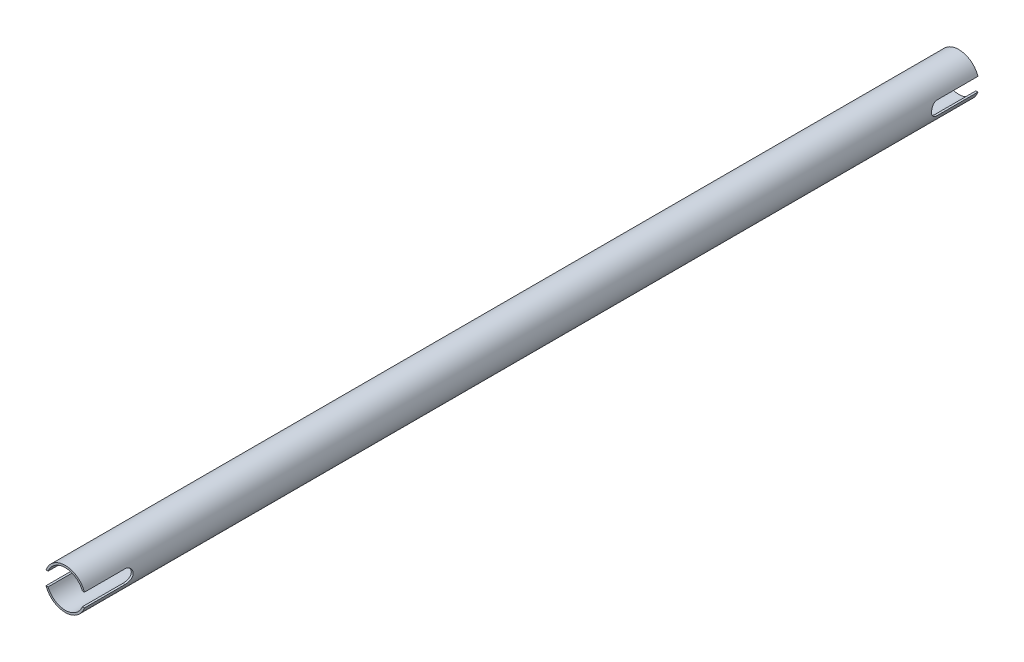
from build123d import *

# Parameters (mm, degrees)
SKETCH1_R               = 9.525
SKETCH1_R_2             = 8.61314
EXTRUDE_THIN1_DEPTH     = 417.195
CUT_EXTRUDE1_DEPTH      = 418.412409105
CUT_EXTRUDE1_DEPTH_BACK = 418.412409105


with BuildPart() as part:
    # Sketch1 → Extrude-Thin1 (new body)
    with BuildSketch(Plane.XY):
        Circle(SKETCH1_R)
        Circle(SKETCH1_R_2, mode=Mode.SUBTRACT)
    extrude(amount=EXTRUDE_THIN1_DEPTH)

    # Sketch2 → Cut-Extrude1 (cut, two sides: drawn at the far end of the back side and taken through both)
    with BuildSketch(Plane(origin=(0, 0, 0), x_dir=(0, 0, -1), z_dir=(1, 0, 0)).offset(-CUT_EXTRUDE1_DEPTH_BACK)):
        with BuildLine():
            Line((-417.195, 3.175), (-398.145, 3.175))
            ThreePointArc((-398.145, 3.175), (-394.97, 0), (-398.145, -3.175))
            Line((-398.145, -3.175), (-417.195, -3.175))
            Line((-417.195, -3.175), (-417.195, 3.175))
        make_face()
        with BuildLine():
            Line((0, -3.175), (-19.05, -3.175))
            ThreePointArc((-19.05, -3.175), (-22.225, 0), (-19.05, 3.175))
            Line((-19.05, 3.175), (0, 3.175))
            Line((0, 3.175), (0, -3.175))
        make_face()
    extrude(amount=CUT_EXTRUDE1_DEPTH + CUT_EXTRUDE1_DEPTH_BACK, mode=Mode.SUBTRACT)


solid = part.part
